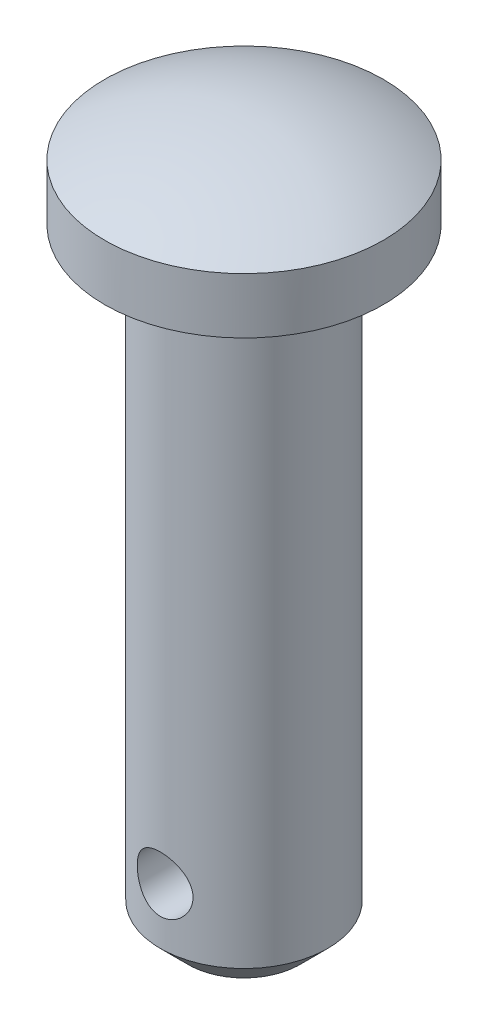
ISO-10303-21;
HEADER;
FILE_DESCRIPTION(('STEP AP214'),'2;1');
FILE_NAME('part.step','',(''),(''),'','','');
FILE_SCHEMA(('AUTOMOTIVE_DESIGN { 1 0 10303 214 1 1 1 1 }'));
ENDSEC;
DATA;
#1=APPLICATION_CONTEXT('core data for automotive mechanical design processes');
#2=APPLICATION_PROTOCOL_DEFINITION('international standard','automotive_design',2000,#1);
#3=PRODUCT_CONTEXT('',#1,'mechanical');
#4=PRODUCT('Part','Part','',(#3));
#5=PRODUCT_RELATED_PRODUCT_CATEGORY('part','',(#4));
#6=PRODUCT_DEFINITION_FORMATION('','',#4);
#7=PRODUCT_DEFINITION_CONTEXT('part definition',#1,'design');
#8=PRODUCT_DEFINITION('design','',#6,#7);
#9=PRODUCT_DEFINITION_SHAPE('','',#8);
#10=(LENGTH_UNIT() NAMED_UNIT(*) SI_UNIT(.MILLI.,.METRE.));
#11=(NAMED_UNIT(*) PLANE_ANGLE_UNIT() SI_UNIT($,.RADIAN.));
#12=(NAMED_UNIT(*) SI_UNIT($,.STERADIAN.) SOLID_ANGLE_UNIT());
#13=UNCERTAINTY_MEASURE_WITH_UNIT(LENGTH_MEASURE(1.E-05),#10,'distance_accuracy_value','');
#14=(GEOMETRIC_REPRESENTATION_CONTEXT(3) GLOBAL_UNCERTAINTY_ASSIGNED_CONTEXT((#13)) GLOBAL_UNIT_ASSIGNED_CONTEXT((#10,
#11,#12)) REPRESENTATION_CONTEXT('',''));
#15=CARTESIAN_POINT('',(0.,0.,0.));
#16=DIRECTION('',(0.,0.,1.));
#17=DIRECTION('',(1.,0.,0.));
#18=AXIS2_PLACEMENT_3D('',#15,#16,#17);
#19=CARTESIAN_POINT('',(0.,0.,0.));
#20=DIRECTION('',(0.,-1.,0.));
#21=DIRECTION('',(0.,0.,-1.));
#22=AXIS2_PLACEMENT_3D('',#19,#20,#21);
#23=CYLINDRICAL_SURFACE('',#22,3.81);
#24=CARTESIAN_POINT('',(0.,-30.9114773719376,0.));
#25=DIRECTION('',(0.,-1.,0.));
#26=DIRECTION('',(0.,0.,-1.));
#27=AXIS2_PLACEMENT_3D('',#24,#25,#26);
#28=CIRCLE('',#27,3.81);
#29=CARTESIAN_POINT('',(0.,-30.9114773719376,-3.81));
#30=VERTEX_POINT('',#29);
#31=EDGE_CURVE('E10',#30,#30,#28,.F.);
#32=ORIENTED_EDGE('',*,*,#31,.T.);
#33=EDGE_LOOP('',(#32));
#34=FACE_BOUND('',#33,.T.);
#35=CARTESIAN_POINT('',(0.,-27.1014773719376,-3.81));
#36=CARTESIAN_POINT('',(0.0692954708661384,-27.1014770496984,-3.81000019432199));
#37=CARTESIAN_POINT('',(0.138588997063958,-27.1071673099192,-3.80809207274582));
#38=CARTESIAN_POINT('',(0.275135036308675,-27.1297083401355,-3.80066816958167));
#39=CARTESIAN_POINT('',(0.342387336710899,-27.1465602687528,-3.79515201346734));
#40=CARTESIAN_POINT('',(0.472862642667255,-27.1907828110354,-3.78111141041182));
#41=CARTESIAN_POINT('',(0.536092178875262,-27.2181358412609,-3.77259199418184));
#42=CARTESIAN_POINT('',(0.657066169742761,-27.2825046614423,-3.75341446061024));
#43=CARTESIAN_POINT('',(0.714809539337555,-27.3195223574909,-3.74275592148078));
#44=CARTESIAN_POINT('',(0.825171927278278,-27.4035161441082,-3.72000899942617));
#45=CARTESIAN_POINT('',(0.877574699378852,-27.4507670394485,-3.70788636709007));
#46=CARTESIAN_POINT('',(0.973877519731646,-27.553301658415,-3.68376599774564));
#47=CARTESIAN_POINT('',(1.01777569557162,-27.6085871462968,-3.67176828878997));
#48=CARTESIAN_POINT('',(1.09705767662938,-27.7275684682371,-3.64887932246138));
#49=CARTESIAN_POINT('',(1.13216036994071,-27.7914604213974,-3.63802979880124));
#50=CARTESIAN_POINT('',(1.19102996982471,-27.9246610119,-3.61918637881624));
#51=CARTESIAN_POINT('',(1.21480033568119,-27.9939679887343,-3.61119161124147));
#52=CARTESIAN_POINT('',(1.24951929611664,-28.1335723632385,-3.59932355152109));
#53=CARTESIAN_POINT('',(1.26087307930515,-28.2037576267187,-3.59532041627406));
#54=CARTESIAN_POINT('',(1.27170322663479,-28.3451423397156,-3.59150483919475));
#55=CARTESIAN_POINT('',(1.27118326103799,-28.4163414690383,-3.59169110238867));
#56=CARTESIAN_POINT('',(1.25859527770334,-28.5542768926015,-3.59611949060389));
#57=CARTESIAN_POINT('',(1.24705606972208,-28.6210684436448,-3.60017588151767));
#58=CARTESIAN_POINT('',(1.21361982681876,-28.7517070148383,-3.6115835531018));
#59=CARTESIAN_POINT('',(1.19172155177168,-28.8155536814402,-3.61893522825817));
#60=CARTESIAN_POINT('',(1.13784260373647,-28.9396915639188,-3.63623747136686));
#61=CARTESIAN_POINT('',(1.10570524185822,-28.9999089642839,-3.64622798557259));
#62=CARTESIAN_POINT('',(1.03236916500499,-29.1142634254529,-3.66766549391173));
#63=CARTESIAN_POINT('',(0.991167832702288,-29.168398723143,-3.67911290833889));
#64=CARTESIAN_POINT('',(0.898333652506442,-29.2720237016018,-3.70290508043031));
#65=CARTESIAN_POINT('',(0.846268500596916,-29.3211232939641,-3.71526548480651));
#66=CARTESIAN_POINT('',(0.734491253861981,-29.4099960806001,-3.73896811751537));
#67=CARTESIAN_POINT('',(0.674778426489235,-29.4497683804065,-3.75031024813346));
#68=CARTESIAN_POINT('',(0.548573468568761,-29.5191716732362,-3.77084727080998));
#69=CARTESIAN_POINT('',(0.482019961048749,-29.5486981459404,-3.7800197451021));
#70=CARTESIAN_POINT('',(0.344511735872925,-29.5960154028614,-3.79502120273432));
#71=CARTESIAN_POINT('',(0.273558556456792,-29.6138102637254,-3.80085134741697));
#72=CARTESIAN_POINT('',(0.132567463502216,-29.636468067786,-3.80831886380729));
#73=CARTESIAN_POINT('',(0.0626231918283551,-29.641858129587,-3.81012702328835));
#74=CARTESIAN_POINT('',(-0.0771843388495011,-29.6410548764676,-3.80985906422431));
#75=CARTESIAN_POINT('',(-0.147047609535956,-29.6348635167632,-3.8077836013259));
#76=CARTESIAN_POINT('',(-0.282600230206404,-29.611490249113,-3.80009431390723));
#77=CARTESIAN_POINT('',(-0.34835186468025,-29.5946318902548,-3.79458472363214));
#78=CARTESIAN_POINT('',(-0.476067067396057,-29.5508076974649,-3.78068645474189));
#79=CARTESIAN_POINT('',(-0.538030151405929,-29.5238405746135,-3.77229740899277));
#80=CARTESIAN_POINT('',(-0.658226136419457,-29.4597779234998,-3.75321742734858));
#81=CARTESIAN_POINT('',(-0.716318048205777,-29.422434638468,-3.74247174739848));
#82=CARTESIAN_POINT('',(-0.825582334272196,-29.3389708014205,-3.71989672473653));
#83=CARTESIAN_POINT('',(-0.876752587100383,-29.2928475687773,-3.70806705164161));
#84=CARTESIAN_POINT('',(-0.973140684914,-29.1906543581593,-3.68397596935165));
#85=CARTESIAN_POINT('',(-1.01798243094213,-29.1342276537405,-3.67171936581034));
#86=CARTESIAN_POINT('',(-1.09760705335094,-29.0143874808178,-3.6487096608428));
#87=CARTESIAN_POINT('',(-1.13238984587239,-28.9509739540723,-3.63795657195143));
#88=CARTESIAN_POINT('',(-1.19074810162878,-28.8189326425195,-3.61927637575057));
#89=CARTESIAN_POINT('',(-1.21434622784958,-28.7503157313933,-3.61134356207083));
#90=CARTESIAN_POINT('',(-1.24954622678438,-28.6097564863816,-3.59931757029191));
#91=CARTESIAN_POINT('',(-1.2611535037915,-28.5378156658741,-3.59522266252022));
#92=CARTESIAN_POINT('',(-1.27162087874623,-28.3966270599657,-3.59153280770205));
#93=CARTESIAN_POINT('',(-1.27110522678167,-28.3274307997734,-3.59171748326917));
#94=CARTESIAN_POINT('',(-1.25887771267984,-28.1901657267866,-3.59602112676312));
#95=CARTESIAN_POINT('',(-1.2471665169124,-28.1220968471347,-3.60013986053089));
#96=CARTESIAN_POINT('',(-1.21332220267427,-27.9903050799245,-3.61168345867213));
#97=CARTESIAN_POINT('',(-1.1913912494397,-27.9265242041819,-3.61904404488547));
#98=CARTESIAN_POINT('',(-1.13789379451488,-27.803498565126,-3.63621826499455));
#99=CARTESIAN_POINT('',(-1.10632515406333,-27.7442548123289,-3.64603244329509));
#100=CARTESIAN_POINT('',(-1.03284107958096,-27.6291831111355,-3.66754193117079));
#101=CARTESIAN_POINT('',(-0.990534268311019,-27.5736170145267,-3.67930063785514));
#102=CARTESIAN_POINT('',(-0.897436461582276,-27.4701713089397,-3.70310862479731));
#103=CARTESIAN_POINT('',(-0.846643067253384,-27.4222938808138,-3.71515798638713));
#104=CARTESIAN_POINT('',(-0.735636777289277,-27.3337039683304,-3.73875338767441));
#105=CARTESIAN_POINT('',(-0.675133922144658,-27.2933434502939,-3.75026150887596));
#106=CARTESIAN_POINT('',(-0.547823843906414,-27.2234095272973,-3.77096008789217));
#107=CARTESIAN_POINT('',(-0.481018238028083,-27.1938333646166,-3.78015113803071));
#108=CARTESIAN_POINT('',(-0.34606693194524,-27.147550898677,-3.79483004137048));
#109=CARTESIAN_POINT('',(-0.27811445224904,-27.1303286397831,-3.80046499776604));
#110=CARTESIAN_POINT('',(-0.140106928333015,-27.1072936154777,-3.80804936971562));
#111=CARTESIAN_POINT('',(-0.0700524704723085,-27.101477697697,-3.80999980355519));
#112=CARTESIAN_POINT('',(0.,-27.1014773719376,-3.81));
#113=B_SPLINE_CURVE_WITH_KNOTS('',3,(#35,#36,#37,#38,#39,#40,#41,#42,#43,#44,#45,#46,#47,#48,
#49,#50,#51,#52,#53,#54,#55,#56,#57,#58,#59,#60,#61,#62,#63,#64,#65,#66,#67,#68,#69,#70,#71,#72,
#73,#74,#75,#76,#77,#78,#79,#80,#81,#82,#83,#84,#85,#86,#87,#88,#89,#90,#91,#92,#93,#94,#95,#96,
#97,#98,#99,#100,#101,#102,#103,#104,#105,#106,#107,#108,#109,#110,#111,#112),.UNSPECIFIED.,.T.,
.F.,(4,2,2,2,2,2,2,2,2,2,2,2,2,2,2,2,2,2,2,2,2,2,2,2,2,2,2,2,2,2,2,2,2,2,2,2,2,2,4),(0.,
0.207628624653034,0.415278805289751,0.622582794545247,0.829927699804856,1.043745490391,
1.25761030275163,1.47762448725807,1.69757146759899,1.91010445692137,2.12257175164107,
2.32532969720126,2.52811192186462,2.73415977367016,2.94026720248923,3.15713498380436,
3.37402355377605,3.59306375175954,3.81202779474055,4.02150050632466,4.23093785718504,
4.43430860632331,4.63770529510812,4.84645207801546,5.05526269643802,5.27356099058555,
5.49186110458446,5.70971697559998,5.92747461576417,6.13404495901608,6.34060300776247,
6.54323795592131,6.74591790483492,6.95744184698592,7.16902568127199,7.38885569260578,
7.6086294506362,7.81858429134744,8.02848109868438),.UNSPECIFIED.);
#114=CARTESIAN_POINT('',(0.,-27.1014773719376,-3.81));
#115=VERTEX_POINT('',#114);
#116=EDGE_CURVE('E47',#115,#115,#113,.T.);
#117=ORIENTED_EDGE('',*,*,#116,.F.);
#118=EDGE_LOOP('',(#117));
#119=FACE_BOUND('',#118,.T.);
#120=CARTESIAN_POINT('',(1.27,-28.3714773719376,3.59210244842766));
#121=CARTESIAN_POINT('',(1.27000032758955,-28.3023027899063,3.5921022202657));
#122=CARTESIAN_POINT('',(1.26432917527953,-28.2331301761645,3.59412246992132));
#123=CARTESIAN_POINT('',(1.24187093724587,-28.0968342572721,3.60194319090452));
#124=CARTESIAN_POINT('',(1.22508202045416,-28.0297112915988,3.60774428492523));
#125=CARTESIAN_POINT('',(1.18104346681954,-27.8995112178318,3.62239818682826));
#126=CARTESIAN_POINT('',(1.15381433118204,-27.8364264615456,3.63124501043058));
#127=CARTESIAN_POINT('',(1.08973826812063,-27.7157001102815,3.65098484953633));
#128=CARTESIAN_POINT('',(1.05288921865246,-27.6580597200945,3.66187831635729));
#129=CARTESIAN_POINT('',(0.969074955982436,-27.547603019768,3.68496201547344));
#130=CARTESIAN_POINT('',(0.921796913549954,-27.4950307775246,3.69718456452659));
#131=CARTESIAN_POINT('',(0.81913433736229,-27.3983947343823,3.72127608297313));
#132=CARTESIAN_POINT('',(0.763748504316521,-27.354332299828,3.73314499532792));
#133=CARTESIAN_POINT('',(0.644657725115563,-27.2748591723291,3.75556610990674));
#134=CARTESIAN_POINT('',(0.580773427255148,-27.2397042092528,3.76607587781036));
#135=CARTESIAN_POINT('',(0.447587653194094,-27.1807360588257,3.78421375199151));
#136=CARTESIAN_POINT('',(0.378287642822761,-27.156919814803,3.79184263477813));
#137=CARTESIAN_POINT('',(0.238796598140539,-27.1221328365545,3.80313025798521));
#138=CARTESIAN_POINT('',(0.16872045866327,-27.1107439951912,3.80691789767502));
#139=CARTESIAN_POINT('',(0.0275563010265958,-27.0998056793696,3.81055382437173));
#140=CARTESIAN_POINT('',(-0.0435314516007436,-27.1002531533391,3.81040312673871));
#141=CARTESIAN_POINT('',(-0.181741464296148,-27.1127095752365,3.80626670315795));
#142=CARTESIAN_POINT('',(-0.248909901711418,-27.1242643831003,3.80243162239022));
#143=CARTESIAN_POINT('',(-0.380293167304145,-27.1578564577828,3.79154648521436));
#144=CARTESIAN_POINT('',(-0.444507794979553,-27.1798944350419,3.78449621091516));
#145=CARTESIAN_POINT('',(-0.569153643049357,-27.2340924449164,3.76778101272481));
#146=CARTESIAN_POINT('',(-0.629524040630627,-27.266381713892,3.75808294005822));
#147=CARTESIAN_POINT('',(-0.744123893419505,-27.3400591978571,3.73708159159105));
#148=CARTESIAN_POINT('',(-0.798351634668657,-27.3814499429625,3.72577786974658));
#149=CARTESIAN_POINT('',(-0.901828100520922,-27.4744438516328,3.70212863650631));
#150=CARTESIAN_POINT('',(-0.950722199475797,-27.5264360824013,3.68975913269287));
#151=CARTESIAN_POINT('',(-1.03921211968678,-27.6379872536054,3.66582115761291));
#152=CARTESIAN_POINT('',(-1.07880650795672,-27.6975473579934,3.65425280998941));
#153=CARTESIAN_POINT('',(-1.14806406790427,-27.8236674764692,3.63309566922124));
#154=CARTESIAN_POINT('',(-1.17757760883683,-27.8903151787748,3.62353744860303));
#155=CARTESIAN_POINT('',(-1.22484285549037,-28.0280330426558,3.6078369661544));
#156=CARTESIAN_POINT('',(-1.24259949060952,-28.0991013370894,3.60169327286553));
#157=CARTESIAN_POINT('',(-1.2651248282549,-28.2402080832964,3.59384138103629));
#158=CARTESIAN_POINT('',(-1.2704433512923,-28.3101483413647,3.59194557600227));
#159=CARTESIAN_POINT('',(-1.26949890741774,-28.4499330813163,3.59227973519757));
#160=CARTESIAN_POINT('',(-1.26323804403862,-28.5197775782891,3.59450895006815));
#161=CARTESIAN_POINT('',(-1.23980657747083,-28.6548867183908,3.60265494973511));
#162=CARTESIAN_POINT('',(-1.22301812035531,-28.7202262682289,3.60844243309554));
#163=CARTESIAN_POINT('',(-1.17946660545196,-28.8471477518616,3.62291063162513));
#164=CARTESIAN_POINT('',(-1.15270177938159,-28.908729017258,3.63159185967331));
#165=CARTESIAN_POINT('',(-1.08899241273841,-29.0285505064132,3.65121034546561));
#166=CARTESIAN_POINT('',(-1.05175192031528,-29.0866228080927,3.66221042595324));
#167=CARTESIAN_POINT('',(-0.968483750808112,-29.195892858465,3.6851052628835));
#168=CARTESIAN_POINT('',(-0.922453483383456,-29.2470885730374,3.69700028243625));
#169=CARTESIAN_POINT('',(-0.82028246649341,-29.3436979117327,3.72103699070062));
#170=CARTESIAN_POINT('',(-0.763761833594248,-29.3887148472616,3.73316301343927));
#171=CARTESIAN_POINT('',(-0.643670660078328,-29.4686508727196,3.7557310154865));
#172=CARTESIAN_POINT('',(-0.580100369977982,-29.5035703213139,3.76617305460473));
#173=CARTESIAN_POINT('',(-0.448030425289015,-29.562000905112,3.78414795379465));
#174=CARTESIAN_POINT('',(-0.379566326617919,-29.5855862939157,3.79169968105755));
#175=CARTESIAN_POINT('',(-0.23934225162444,-29.620811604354,3.80312435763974));
#176=CARTESIAN_POINT('',(-0.167583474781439,-29.6324558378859,3.80699863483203));
#177=CARTESIAN_POINT('',(-0.0264354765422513,-29.6430802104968,3.81053166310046));
#178=CARTESIAN_POINT('',(0.0429065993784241,-29.6426298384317,3.81037998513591));
#179=CARTESIAN_POINT('',(0.18048115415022,-29.6304825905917,3.80634489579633));
#180=CARTESIAN_POINT('',(0.2487137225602,-29.6187866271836,3.80246178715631));
#181=CARTESIAN_POINT('',(0.381053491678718,-29.5848579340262,3.79146961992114));
#182=CARTESIAN_POINT('',(0.445209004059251,-29.5627955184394,3.78441278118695));
#183=CARTESIAN_POINT('',(0.568932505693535,-29.5089179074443,3.76779994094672));
#184=CARTESIAN_POINT('',(0.628499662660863,-29.4771009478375,3.75824348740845));
#185=CARTESIAN_POINT('',(0.743755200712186,-29.403264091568,3.7371765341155));
#186=CARTESIAN_POINT('',(0.799218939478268,-29.3609106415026,3.72560688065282));
#187=CARTESIAN_POINT('',(0.902437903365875,-29.2677704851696,3.70196095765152));
#188=CARTESIAN_POINT('',(0.950190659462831,-29.2169810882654,3.68988452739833));
#189=CARTESIAN_POINT('',(1.03853209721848,-29.1060334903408,3.66602365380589));
#190=CARTESIAN_POINT('',(1.07876716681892,-29.0455863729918,3.65426914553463));
#191=CARTESIAN_POINT('',(1.14847921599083,-28.9184226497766,3.6329644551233));
#192=CARTESIAN_POINT('',(1.17795900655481,-28.8517076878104,3.6234136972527));
#193=CARTESIAN_POINT('',(1.22408166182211,-28.7169658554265,3.6080869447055));
#194=CARTESIAN_POINT('',(1.24124454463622,-28.649134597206,3.6021598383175));
#195=CARTESIAN_POINT('',(1.26420158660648,-28.5113601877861,3.59416837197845));
#196=CARTESIAN_POINT('',(1.26999966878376,-28.4414177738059,3.59210267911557));
#197=CARTESIAN_POINT('',(1.27,-28.3714773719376,3.59210244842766));
#198=B_SPLINE_CURVE_WITH_KNOTS('',3,(#120,#121,#122,#123,#124,#125,#126,#127,#128,#129,#130,
#131,#132,#133,#134,#135,#136,#137,#138,#139,#140,#141,#142,#143,#144,#145,#146,#147,#148,#149,
#150,#151,#152,#153,#154,#155,#156,#157,#158,#159,#160,#161,#162,#163,#164,#165,#166,#167,#168,
#169,#170,#171,#172,#173,#174,#175,#176,#177,#178,#179,#180,#181,#182,#183,#184,#185,#186,#187,
#188,#189,#190,#191,#192,#193,#194,#195,#196,#197),.UNSPECIFIED.,.T.,.F.,(4,2,2,2,2,2,2,2,2,2,2,
2,2,2,2,2,2,2,2,2,2,2,2,2,2,2,2,2,2,2,2,2,2,2,2,2,2,2,4),(0.,0.207264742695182,
0.414563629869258,0.621457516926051,0.828397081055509,1.04268698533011,1.25701126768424,
1.47692752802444,1.69678447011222,1.90899184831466,2.12114451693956,2.32497636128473,
2.52882202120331,2.73534701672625,2.94192949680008,3.15823821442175,3.37458024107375,
3.59400652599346,3.81334075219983,4.02277950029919,4.23218020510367,4.43438782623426,
4.63663130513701,4.84528949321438,5.05400926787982,5.27277086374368,5.49152468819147,
5.70882514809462,5.92604711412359,6.13305967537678,6.34005544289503,6.54376334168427,
6.74750810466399,6.95878109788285,7.17012160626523,7.38973506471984,7.60929108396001,
7.81892279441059,8.02848212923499),.UNSPECIFIED.);
#199=CARTESIAN_POINT('',(1.27,-28.3714773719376,3.59210244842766));
#200=VERTEX_POINT('',#199);
#201=EDGE_CURVE('E54',#200,#200,#198,.T.);
#202=ORIENTED_EDGE('',*,*,#201,.F.);
#203=EDGE_LOOP('',(#202));
#204=FACE_BOUND('',#203,.T.);
#205=CARTESIAN_POINT('',(0.,-4.24147737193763,0.));
#206=DIRECTION('',(0.,-1.,0.));
#207=DIRECTION('',(0.,0.,-1.));
#208=AXIS2_PLACEMENT_3D('',#205,#206,#207);
#209=CIRCLE('',#208,3.81);
#210=CARTESIAN_POINT('',(0.,-4.24147737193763,-3.81));
#211=VERTEX_POINT('',#210);
#212=EDGE_CURVE('E53',#211,#211,#209,.T.);
#213=ORIENTED_EDGE('',*,*,#212,.T.);
#214=EDGE_LOOP('',(#213));
#215=FACE_BOUND('',#214,.T.);
#216=ADVANCED_FACE('F29',(#34,#119,#204,#215),#23,.T.);
#217=CARTESIAN_POINT('',(3.81,-32.1814773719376,0.));
#218=DIRECTION('',(0.,-1.,0.));
#219=DIRECTION('',(0.,0.,-1.));
#220=AXIS2_PLACEMENT_3D('',#217,#218,#219);
#221=PLANE('',#220);
#222=CARTESIAN_POINT('',(0.,-32.1814773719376,0.));
#223=DIRECTION('',(0.,-1.,0.));
#224=DIRECTION('',(0.,0.,-1.));
#225=AXIS2_PLACEMENT_3D('',#222,#223,#224);
#226=CIRCLE('',#225,2.54);
#227=CARTESIAN_POINT('',(0.,-32.1814773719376,-2.54));
#228=VERTEX_POINT('',#227);
#229=EDGE_CURVE('E36',#228,#228,#226,.T.);
#230=ORIENTED_EDGE('',*,*,#229,.T.);
#231=EDGE_LOOP('',(#230));
#232=FACE_BOUND('',#231,.T.);
#233=ADVANCED_FACE('F75',(#232),#221,.T.);
#234=CARTESIAN_POINT('',(0.,-12.7,0.));
#235=DIRECTION('',(0.,-1.,0.));
#236=DIRECTION('',(1.,0.,0.));
#237=AXIS2_PLACEMENT_3D('',#234,#235,#236);
#238=SPHERICAL_SURFACE('',#237,12.7);
#239=CARTESIAN_POINT('',(0.,-1.70147737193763,0.));
#240=DIRECTION('',(0.,-1.,0.));
#241=DIRECTION('',(0.,0.,-1.));
#242=AXIS2_PLACEMENT_3D('',#239,#240,#241);
#243=CIRCLE('',#242,6.35);
#244=CARTESIAN_POINT('',(0.,-1.70147737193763,-6.35));
#245=VERTEX_POINT('',#244);
#246=EDGE_CURVE('E40',#245,#245,#243,.T.);
#247=ORIENTED_EDGE('',*,*,#246,.F.);
#248=EDGE_LOOP('',(#247));
#249=FACE_BOUND('',#248,.T.);
#250=ADVANCED_FACE('F72',(#249),#238,.T.);
#251=CARTESIAN_POINT('',(0.,0.,0.));
#252=DIRECTION('',(0.,-1.,0.));
#253=DIRECTION('',(0.,0.,-1.));
#254=AXIS2_PLACEMENT_3D('',#251,#252,#253);
#255=CYLINDRICAL_SURFACE('',#254,6.35);
#256=ORIENTED_EDGE('',*,*,#246,.T.);
#257=EDGE_LOOP('',(#256));
#258=FACE_BOUND('',#257,.T.);
#259=CARTESIAN_POINT('',(0.,-4.24147737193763,0.));
#260=DIRECTION('',(0.,-1.,0.));
#261=DIRECTION('',(0.,0.,-1.));
#262=AXIS2_PLACEMENT_3D('',#259,#260,#261);
#263=CIRCLE('',#262,6.35);
#264=CARTESIAN_POINT('',(0.,-4.24147737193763,-6.35));
#265=VERTEX_POINT('',#264);
#266=EDGE_CURVE('E44',#265,#265,#263,.T.);
#267=ORIENTED_EDGE('',*,*,#266,.F.);
#268=EDGE_LOOP('',(#267));
#269=FACE_BOUND('',#268,.T.);
#270=ADVANCED_FACE('F68',(#258,#269),#255,.T.);
#271=CARTESIAN_POINT('',(3.81,-4.24147737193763,0.));
#272=DIRECTION('',(0.,-1.,0.));
#273=DIRECTION('',(0.,0.,-1.));
#274=AXIS2_PLACEMENT_3D('',#271,#272,#273);
#275=PLANE('',#274);
#276=ORIENTED_EDGE('',*,*,#266,.T.);
#277=EDGE_LOOP('',(#276));
#278=FACE_BOUND('',#277,.T.);
#279=ORIENTED_EDGE('',*,*,#212,.F.);
#280=EDGE_LOOP('',(#279));
#281=FACE_BOUND('',#280,.T.);
#282=ADVANCED_FACE('F63',(#278,#281),#275,.T.);
#283=CARTESIAN_POINT('',(0.,-28.3714773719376,-6.35));
#284=DIRECTION('',(0.,0.,1.));
#285=DIRECTION('',(1.,0.,0.));
#286=AXIS2_PLACEMENT_3D('',#283,#284,#285);
#287=CYLINDRICAL_SURFACE('',#286,1.27);
#288=ORIENTED_EDGE('',*,*,#116,.T.);
#289=EDGE_LOOP('',(#288));
#290=FACE_BOUND('',#289,.T.);
#291=ORIENTED_EDGE('',*,*,#201,.T.);
#292=EDGE_LOOP('',(#291));
#293=FACE_BOUND('',#292,.T.);
#294=ADVANCED_FACE('F59',(#290,#293),#287,.F.);
#295=CARTESIAN_POINT('',(0.,-32.1814773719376,0.));
#296=DIRECTION('',(0.,1.,0.));
#297=DIRECTION('',(0.,0.,1.));
#298=AXIS2_PLACEMENT_3D('',#295,#296,#297);
#299=CONICAL_SURFACE('',#298,2.54,0.785398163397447);
#300=ORIENTED_EDGE('',*,*,#31,.F.);
#301=EDGE_LOOP('',(#300));
#302=FACE_BOUND('',#301,.T.);
#303=ORIENTED_EDGE('',*,*,#229,.F.);
#304=EDGE_LOOP('',(#303));
#305=FACE_BOUND('',#304,.T.);
#306=ADVANCED_FACE('F31',(#302,#305),#299,.T.);
#307=CLOSED_SHELL('',(#216,#233,#250,#270,#282,#294,#306));
#308=MANIFOLD_SOLID_BREP('B2',#307);
#309=ADVANCED_BREP_SHAPE_REPRESENTATION('',(#18,#308),#14);
#310=SHAPE_DEFINITION_REPRESENTATION(#9,#309);
ENDSEC;
END-ISO-10303-21;
